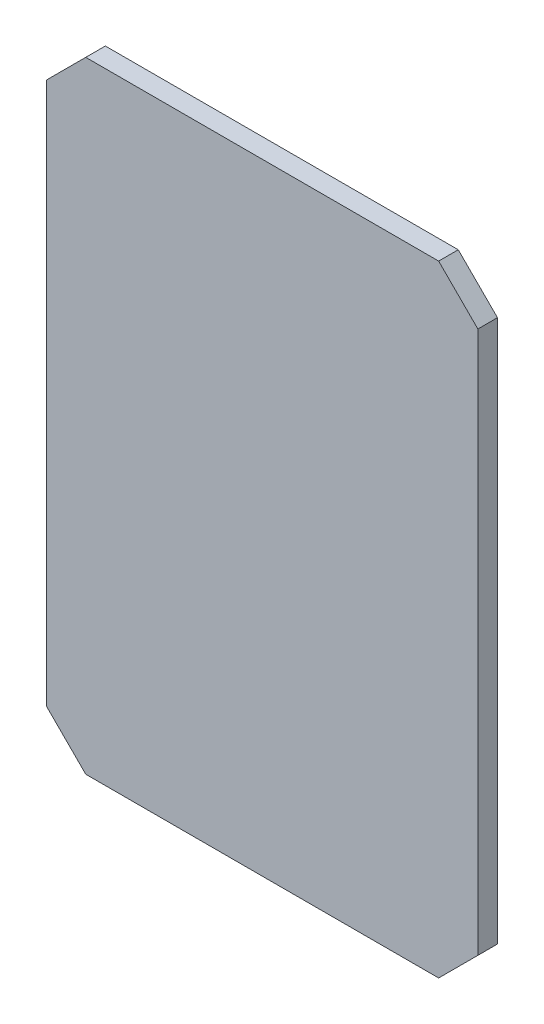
ISO-10303-21;
HEADER;
FILE_DESCRIPTION(('STEP AP214'),'2;1');
FILE_NAME('part.step','',(''),(''),'','','');
FILE_SCHEMA(('AUTOMOTIVE_DESIGN { 1 0 10303 214 1 1 1 1 }'));
ENDSEC;
DATA;
#1=APPLICATION_CONTEXT('core data for automotive mechanical design processes');
#2=APPLICATION_PROTOCOL_DEFINITION('international standard','automotive_design',2000,#1);
#3=PRODUCT_CONTEXT('',#1,'mechanical');
#4=PRODUCT('Part','Part','',(#3));
#5=PRODUCT_RELATED_PRODUCT_CATEGORY('part','',(#4));
#6=PRODUCT_DEFINITION_FORMATION('','',#4);
#7=PRODUCT_DEFINITION_CONTEXT('part definition',#1,'design');
#8=PRODUCT_DEFINITION('design','',#6,#7);
#9=PRODUCT_DEFINITION_SHAPE('','',#8);
#10=(LENGTH_UNIT() NAMED_UNIT(*) SI_UNIT(.MILLI.,.METRE.));
#11=(NAMED_UNIT(*) PLANE_ANGLE_UNIT() SI_UNIT($,.RADIAN.));
#12=(NAMED_UNIT(*) SI_UNIT($,.STERADIAN.) SOLID_ANGLE_UNIT());
#13=UNCERTAINTY_MEASURE_WITH_UNIT(LENGTH_MEASURE(1.E-05),#10,'distance_accuracy_value','');
#14=(GEOMETRIC_REPRESENTATION_CONTEXT(3) GLOBAL_UNCERTAINTY_ASSIGNED_CONTEXT((#13)) GLOBAL_UNIT_ASSIGNED_CONTEXT((#10,
#11,#12)) REPRESENTATION_CONTEXT('',''));
#15=CARTESIAN_POINT('',(0.,0.,0.));
#16=DIRECTION('',(0.,0.,1.));
#17=DIRECTION('',(1.,0.,0.));
#18=AXIS2_PLACEMENT_3D('',#15,#16,#17);
#19=CARTESIAN_POINT('',(-33.,47.5,3.));
#20=DIRECTION('',(1.,0.,0.));
#21=DIRECTION('',(0.,0.,-1.));
#22=AXIS2_PLACEMENT_3D('',#19,#20,#21);
#23=PLANE('',#22);
#24=DIRECTION('',(0.,-1.,0.));
#25=VECTOR('',#24,1.);
#26=CARTESIAN_POINT('',(-33.,47.5,0.));
#27=LINE('',#26,#25);
#28=CARTESIAN_POINT('',(-33.,41.5,0.));
#29=VERTEX_POINT('',#28);
#30=CARTESIAN_POINT('',(-33.,-41.5,0.));
#31=VERTEX_POINT('',#30);
#32=EDGE_CURVE('E125',#29,#31,#27,.T.);
#33=ORIENTED_EDGE('',*,*,#32,.T.);
#34=DIRECTION('',(0.,0.,1.));
#35=VECTOR('',#34,1.);
#36=CARTESIAN_POINT('',(-33.,-41.5,3.));
#37=LINE('',#36,#35);
#38=CARTESIAN_POINT('',(-33.,-41.5,3.));
#39=VERTEX_POINT('',#38);
#40=EDGE_CURVE('E103',#31,#39,#37,.T.);
#41=ORIENTED_EDGE('',*,*,#40,.T.);
#42=DIRECTION('',(0.,-1.,0.));
#43=VECTOR('',#42,1.);
#44=CARTESIAN_POINT('',(-33.,47.5,3.));
#45=LINE('',#44,#43);
#46=CARTESIAN_POINT('',(-33.,41.5,3.));
#47=VERTEX_POINT('',#46);
#48=EDGE_CURVE('E134',#47,#39,#45,.T.);
#49=ORIENTED_EDGE('',*,*,#48,.F.);
#50=DIRECTION('',(0.,0.,-1.));
#51=VECTOR('',#50,1.);
#52=CARTESIAN_POINT('',(-33.,41.5,3.));
#53=LINE('',#52,#51);
#54=EDGE_CURVE('E108',#47,#29,#53,.T.);
#55=ORIENTED_EDGE('',*,*,#54,.T.);
#56=EDGE_LOOP('',(#33,#41,#49,#55));
#57=FACE_BOUND('',#56,.T.);
#58=ADVANCED_FACE('F32',(#57),#23,.F.);
#59=CARTESIAN_POINT('',(-33.,-47.5,3.));
#60=DIRECTION('',(0.,1.,0.));
#61=DIRECTION('',(0.,0.,1.));
#62=AXIS2_PLACEMENT_3D('',#59,#60,#61);
#63=PLANE('',#62);
#64=DIRECTION('',(1.,0.,0.));
#65=VECTOR('',#64,1.);
#66=CARTESIAN_POINT('',(-33.,-47.5,3.));
#67=LINE('',#66,#65);
#68=CARTESIAN_POINT('',(-27.,-47.5,3.));
#69=VERTEX_POINT('',#68);
#70=CARTESIAN_POINT('',(27.,-47.5,3.));
#71=VERTEX_POINT('',#70);
#72=EDGE_CURVE('E118',#69,#71,#67,.T.);
#73=ORIENTED_EDGE('',*,*,#72,.F.);
#74=DIRECTION('',(0.,0.,-1.));
#75=VECTOR('',#74,1.);
#76=CARTESIAN_POINT('',(-27.,-47.5,3.));
#77=LINE('',#76,#75);
#78=CARTESIAN_POINT('',(-27.,-47.5,0.));
#79=VERTEX_POINT('',#78);
#80=EDGE_CURVE('E102',#69,#79,#77,.T.);
#81=ORIENTED_EDGE('',*,*,#80,.T.);
#82=DIRECTION('',(1.,0.,0.));
#83=VECTOR('',#82,1.);
#84=CARTESIAN_POINT('',(-33.,-47.5,0.));
#85=LINE('',#84,#83);
#86=CARTESIAN_POINT('',(27.,-47.5,0.));
#87=VERTEX_POINT('',#86);
#88=EDGE_CURVE('E115',#79,#87,#85,.T.);
#89=ORIENTED_EDGE('',*,*,#88,.T.);
#90=DIRECTION('',(0.,0.,1.));
#91=VECTOR('',#90,1.);
#92=CARTESIAN_POINT('',(27.,-47.5,3.));
#93=LINE('',#92,#91);
#94=EDGE_CURVE('E120',#87,#71,#93,.T.);
#95=ORIENTED_EDGE('',*,*,#94,.T.);
#96=EDGE_LOOP('',(#73,#81,#89,#95));
#97=FACE_BOUND('',#96,.T.);
#98=ADVANCED_FACE('F114',(#97),#63,.F.);
#99=CARTESIAN_POINT('',(33.,47.5,3.));
#100=DIRECTION('',(-1.,0.,0.));
#101=DIRECTION('',(0.,-1.,0.));
#102=AXIS2_PLACEMENT_3D('',#99,#100,#101);
#103=PLANE('',#102);
#104=DIRECTION('',(0.,1.,0.));
#105=VECTOR('',#104,1.);
#106=CARTESIAN_POINT('',(33.,47.5,0.));
#107=LINE('',#106,#105);
#108=CARTESIAN_POINT('',(33.,-41.5,0.));
#109=VERTEX_POINT('',#108);
#110=CARTESIAN_POINT('',(33.,41.5,0.));
#111=VERTEX_POINT('',#110);
#112=EDGE_CURVE('E124',#109,#111,#107,.T.);
#113=ORIENTED_EDGE('',*,*,#112,.T.);
#114=DIRECTION('',(0.,0.,1.));
#115=VECTOR('',#114,1.);
#116=CARTESIAN_POINT('',(33.,41.5,3.));
#117=LINE('',#116,#115);
#118=CARTESIAN_POINT('',(33.,41.5,3.));
#119=VERTEX_POINT('',#118);
#120=EDGE_CURVE('E11',#111,#119,#117,.T.);
#121=ORIENTED_EDGE('',*,*,#120,.T.);
#122=DIRECTION('',(0.,1.,0.));
#123=VECTOR('',#122,1.);
#124=CARTESIAN_POINT('',(33.,47.5,3.));
#125=LINE('',#124,#123);
#126=CARTESIAN_POINT('',(33.,-41.5,3.));
#127=VERTEX_POINT('',#126);
#128=EDGE_CURVE('E160',#127,#119,#125,.T.);
#129=ORIENTED_EDGE('',*,*,#128,.F.);
#130=DIRECTION('',(0.,0.,-1.));
#131=VECTOR('',#130,1.);
#132=CARTESIAN_POINT('',(33.,-41.5,3.));
#133=LINE('',#132,#131);
#134=EDGE_CURVE('E40',#127,#109,#133,.T.);
#135=ORIENTED_EDGE('',*,*,#134,.T.);
#136=EDGE_LOOP('',(#113,#121,#129,#135));
#137=FACE_BOUND('',#136,.T.);
#138=ADVANCED_FACE('F158',(#137),#103,.F.);
#139=CARTESIAN_POINT('',(-33.,47.5,3.));
#140=DIRECTION('',(0.,-1.,0.));
#141=DIRECTION('',(0.,0.,-1.));
#142=AXIS2_PLACEMENT_3D('',#139,#140,#141);
#143=PLANE('',#142);
#144=DIRECTION('',(-1.,0.,0.));
#145=VECTOR('',#144,1.);
#146=CARTESIAN_POINT('',(-33.,47.5,0.));
#147=LINE('',#146,#145);
#148=CARTESIAN_POINT('',(27.,47.5,0.));
#149=VERTEX_POINT('',#148);
#150=CARTESIAN_POINT('',(-27.,47.5,0.));
#151=VERTEX_POINT('',#150);
#152=EDGE_CURVE('E128',#149,#151,#147,.T.);
#153=ORIENTED_EDGE('',*,*,#152,.T.);
#154=DIRECTION('',(0.,0.,1.));
#155=VECTOR('',#154,1.);
#156=CARTESIAN_POINT('',(-27.,47.5,3.));
#157=LINE('',#156,#155);
#158=CARTESIAN_POINT('',(-27.,47.5,3.));
#159=VERTEX_POINT('',#158);
#160=EDGE_CURVE('E47',#151,#159,#157,.T.);
#161=ORIENTED_EDGE('',*,*,#160,.T.);
#162=DIRECTION('',(-1.,0.,0.));
#163=VECTOR('',#162,1.);
#164=CARTESIAN_POINT('',(-33.,47.5,3.));
#165=LINE('',#164,#163);
#166=CARTESIAN_POINT('',(27.,47.5,3.));
#167=VERTEX_POINT('',#166);
#168=EDGE_CURVE('E135',#167,#159,#165,.T.);
#169=ORIENTED_EDGE('',*,*,#168,.F.);
#170=DIRECTION('',(0.,0.,-1.));
#171=VECTOR('',#170,1.);
#172=CARTESIAN_POINT('',(27.,47.5,3.));
#173=LINE('',#172,#171);
#174=EDGE_CURVE('E151',#167,#149,#173,.T.);
#175=ORIENTED_EDGE('',*,*,#174,.T.);
#176=EDGE_LOOP('',(#153,#161,#169,#175));
#177=FACE_BOUND('',#176,.T.);
#178=ADVANCED_FACE('F167',(#177),#143,.F.);
#179=CARTESIAN_POINT('',(0.,0.,3.));
#180=DIRECTION('',(0.,0.,1.));
#181=DIRECTION('',(1.,0.,0.));
#182=AXIS2_PLACEMENT_3D('',#179,#180,#181);
#183=PLANE('',#182);
#184=ORIENTED_EDGE('',*,*,#48,.T.);
#185=DIRECTION('',(-0.707106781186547,0.707106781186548,0.));
#186=VECTOR('',#185,1.);
#187=CARTESIAN_POINT('',(-37.25,-37.25,3.));
#188=LINE('',#187,#186);
#189=EDGE_CURVE('E149',#39,#69,#188,.F.);
#190=ORIENTED_EDGE('',*,*,#189,.T.);
#191=ORIENTED_EDGE('',*,*,#72,.T.);
#192=DIRECTION('',(-0.707106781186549,-0.707106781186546,0.));
#193=VECTOR('',#192,1.);
#194=CARTESIAN_POINT('',(37.2499999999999,-37.2500000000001,3.));
#195=LINE('',#194,#193);
#196=EDGE_CURVE('E144',#71,#127,#195,.F.);
#197=ORIENTED_EDGE('',*,*,#196,.T.);
#198=ORIENTED_EDGE('',*,*,#128,.T.);
#199=DIRECTION('',(0.707106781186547,-0.707106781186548,0.));
#200=VECTOR('',#199,1.);
#201=CARTESIAN_POINT('',(37.25,37.25,3.));
#202=LINE('',#201,#200);
#203=EDGE_CURVE('E54',#119,#167,#202,.F.);
#204=ORIENTED_EDGE('',*,*,#203,.T.);
#205=ORIENTED_EDGE('',*,*,#168,.T.);
#206=DIRECTION('',(0.707106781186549,0.707106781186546,0.));
#207=VECTOR('',#206,1.);
#208=CARTESIAN_POINT('',(-37.2499999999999,37.2500000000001,3.));
#209=LINE('',#208,#207);
#210=EDGE_CURVE('E147',#159,#47,#209,.F.);
#211=ORIENTED_EDGE('',*,*,#210,.T.);
#212=EDGE_LOOP('',(#184,#190,#191,#197,#198,#204,#205,#211));
#213=FACE_BOUND('',#212,.T.);
#214=ADVANCED_FACE('F174',(#213),#183,.T.);
#215=CARTESIAN_POINT('',(0.,0.,0.));
#216=DIRECTION('',(0.,0.,1.));
#217=DIRECTION('',(1.,0.,0.));
#218=AXIS2_PLACEMENT_3D('',#215,#216,#217);
#219=PLANE('',#218);
#220=ORIENTED_EDGE('',*,*,#88,.F.);
#221=DIRECTION('',(0.707106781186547,-0.707106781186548,0.));
#222=VECTOR('',#221,1.);
#223=CARTESIAN_POINT('',(-27.,-47.5,0.));
#224=LINE('',#223,#222);
#225=EDGE_CURVE('E98',#79,#31,#224,.F.);
#226=ORIENTED_EDGE('',*,*,#225,.T.);
#227=ORIENTED_EDGE('',*,*,#32,.F.);
#228=DIRECTION('',(-0.707106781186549,-0.707106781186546,0.));
#229=VECTOR('',#228,1.);
#230=CARTESIAN_POINT('',(-33.,41.5,0.));
#231=LINE('',#230,#229);
#232=EDGE_CURVE('E109',#29,#151,#231,.F.);
#233=ORIENTED_EDGE('',*,*,#232,.T.);
#234=ORIENTED_EDGE('',*,*,#152,.F.);
#235=DIRECTION('',(-0.707106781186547,0.707106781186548,0.));
#236=VECTOR('',#235,1.);
#237=CARTESIAN_POINT('',(27.,47.5,0.));
#238=LINE('',#237,#236);
#239=EDGE_CURVE('E138',#149,#111,#238,.F.);
#240=ORIENTED_EDGE('',*,*,#239,.T.);
#241=ORIENTED_EDGE('',*,*,#112,.F.);
#242=DIRECTION('',(0.707106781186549,0.707106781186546,0.));
#243=VECTOR('',#242,1.);
#244=CARTESIAN_POINT('',(33.,-41.5,0.));
#245=LINE('',#244,#243);
#246=EDGE_CURVE('E119',#109,#87,#245,.F.);
#247=ORIENTED_EDGE('',*,*,#246,.T.);
#248=EDGE_LOOP('',(#220,#226,#227,#233,#234,#240,#241,#247));
#249=FACE_BOUND('',#248,.T.);
#250=ADVANCED_FACE('F122',(#249),#219,.F.);
#251=CARTESIAN_POINT('',(-27.,-47.5,3.));
#252=DIRECTION('',(0.707106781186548,0.707106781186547,0.));
#253=DIRECTION('',(0.,0.,-1.));
#254=AXIS2_PLACEMENT_3D('',#251,#252,#253);
#255=PLANE('',#254);
#256=ORIENTED_EDGE('',*,*,#189,.F.);
#257=ORIENTED_EDGE('',*,*,#40,.F.);
#258=ORIENTED_EDGE('',*,*,#225,.F.);
#259=ORIENTED_EDGE('',*,*,#80,.F.);
#260=EDGE_LOOP('',(#256,#257,#258,#259));
#261=FACE_BOUND('',#260,.T.);
#262=ADVANCED_FACE('F101',(#261),#255,.F.);
#263=CARTESIAN_POINT('',(-33.,41.5,3.));
#264=DIRECTION('',(0.707106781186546,-0.707106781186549,0.));
#265=DIRECTION('',(0.,0.,-1.));
#266=AXIS2_PLACEMENT_3D('',#263,#264,#265);
#267=PLANE('',#266);
#268=ORIENTED_EDGE('',*,*,#210,.F.);
#269=ORIENTED_EDGE('',*,*,#160,.F.);
#270=ORIENTED_EDGE('',*,*,#232,.F.);
#271=ORIENTED_EDGE('',*,*,#54,.F.);
#272=EDGE_LOOP('',(#268,#269,#270,#271));
#273=FACE_BOUND('',#272,.T.);
#274=ADVANCED_FACE('F178',(#273),#267,.F.);
#275=CARTESIAN_POINT('',(27.,47.5,3.));
#276=DIRECTION('',(-0.707106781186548,-0.707106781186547,0.));
#277=DIRECTION('',(0.,0.,-1.));
#278=AXIS2_PLACEMENT_3D('',#275,#276,#277);
#279=PLANE('',#278);
#280=ORIENTED_EDGE('',*,*,#203,.F.);
#281=ORIENTED_EDGE('',*,*,#120,.F.);
#282=ORIENTED_EDGE('',*,*,#239,.F.);
#283=ORIENTED_EDGE('',*,*,#174,.F.);
#284=EDGE_LOOP('',(#280,#281,#282,#283));
#285=FACE_BOUND('',#284,.T.);
#286=ADVANCED_FACE('F166',(#285),#279,.F.);
#287=CARTESIAN_POINT('',(33.,-41.5,3.));
#288=DIRECTION('',(-0.707106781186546,0.707106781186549,0.));
#289=DIRECTION('',(0.,0.,-1.));
#290=AXIS2_PLACEMENT_3D('',#287,#288,#289);
#291=PLANE('',#290);
#292=ORIENTED_EDGE('',*,*,#196,.F.);
#293=ORIENTED_EDGE('',*,*,#94,.F.);
#294=ORIENTED_EDGE('',*,*,#246,.F.);
#295=ORIENTED_EDGE('',*,*,#134,.F.);
#296=EDGE_LOOP('',(#292,#293,#294,#295));
#297=FACE_BOUND('',#296,.T.);
#298=ADVANCED_FACE('F34',(#297),#291,.F.);
#299=CLOSED_SHELL('',(#58,#98,#138,#178,#214,#250,#262,#274,#286,#298));
#300=MANIFOLD_SOLID_BREP('B2',#299);
#301=ADVANCED_BREP_SHAPE_REPRESENTATION('',(#18,#300),#14);
#302=SHAPE_DEFINITION_REPRESENTATION(#9,#301);
ENDSEC;
END-ISO-10303-21;
